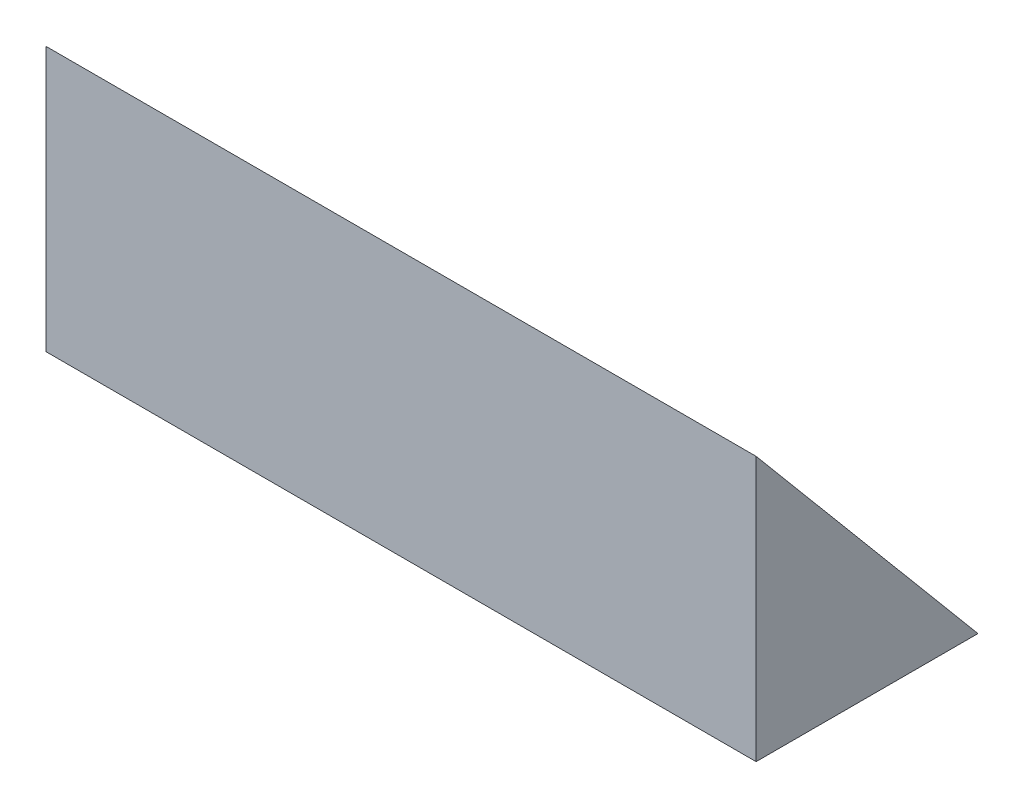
from build123d import *

# Parameters (mm, degrees)
BOSS_EXTRU_1_DEPTH      = 1600
ESQUISSE2_R             = 5
ENL_V_MAT_EXTRU_1_DEPTH = 10


with BuildPart() as part:
    # Esquisse1 → Boss.-Extru.1 (new body)
    with BuildSketch(Plane(origin=(0, 0, 0), x_dir=(0, 0, -1), z_dir=(1, 0, 0))):
        Polygon((0, 0), (500, 0), (0, 595.876796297), align=None)
    extrude(amount=BOSS_EXTRU_1_DEPTH)

    # Esquisse2 → Enl_v. mat.-Extru.1 (cut)
    with BuildSketch(Plane.XZ):
        with Locations(Location((550, -250, 0), (0, 0, 270))):
            Circle(ESQUISSE2_R)
        with Locations(Location((1050, -250, 0), (0, 0, 90))):
            Circle(ESQUISSE2_R)
    extrude(amount=-ENL_V_MAT_EXTRU_1_DEPTH, mode=Mode.SUBTRACT)


solid = part.part
